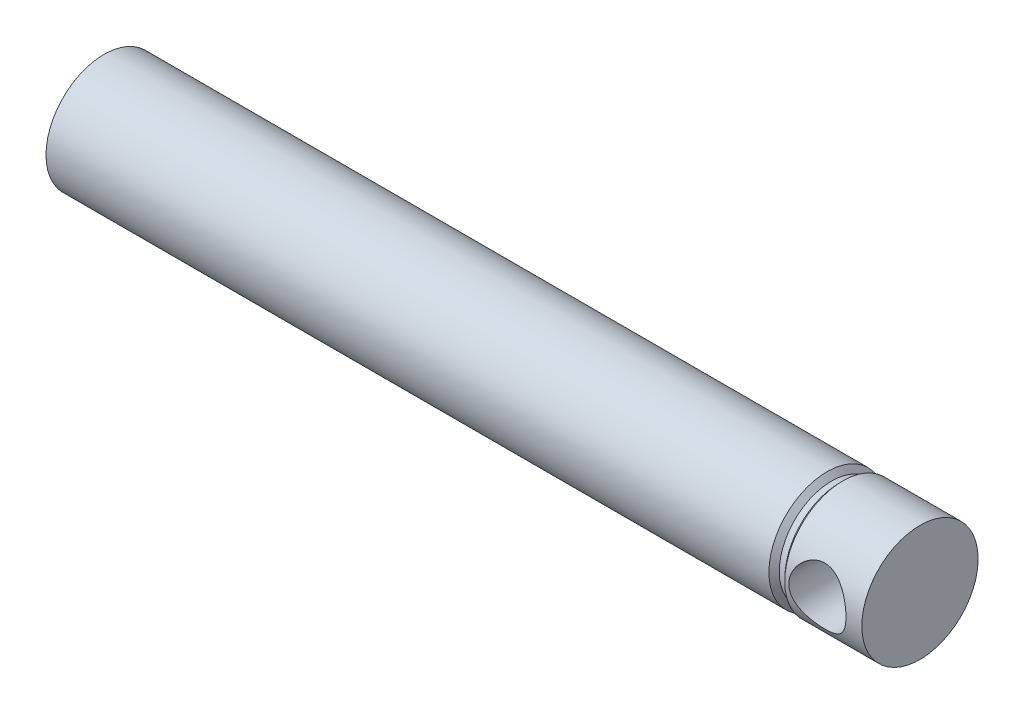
ISO-10303-21;
HEADER;
FILE_DESCRIPTION(('STEP AP214'),'2;1');
FILE_NAME('part.step','',(''),(''),'','','');
FILE_SCHEMA(('AUTOMOTIVE_DESIGN { 1 0 10303 214 1 1 1 1 }'));
ENDSEC;
DATA;
#1=APPLICATION_CONTEXT('core data for automotive mechanical design processes');
#2=APPLICATION_PROTOCOL_DEFINITION('international standard','automotive_design',2000,#1);
#3=PRODUCT_CONTEXT('',#1,'mechanical');
#4=PRODUCT('Part','Part','',(#3));
#5=PRODUCT_RELATED_PRODUCT_CATEGORY('part','',(#4));
#6=PRODUCT_DEFINITION_FORMATION('','',#4);
#7=PRODUCT_DEFINITION_CONTEXT('part definition',#1,'design');
#8=PRODUCT_DEFINITION('design','',#6,#7);
#9=PRODUCT_DEFINITION_SHAPE('','',#8);
#10=(LENGTH_UNIT() NAMED_UNIT(*) SI_UNIT(.MILLI.,.METRE.));
#11=(NAMED_UNIT(*) PLANE_ANGLE_UNIT() SI_UNIT($,.RADIAN.));
#12=(NAMED_UNIT(*) SI_UNIT($,.STERADIAN.) SOLID_ANGLE_UNIT());
#13=UNCERTAINTY_MEASURE_WITH_UNIT(LENGTH_MEASURE(1.E-05),#10,'distance_accuracy_value','');
#14=(GEOMETRIC_REPRESENTATION_CONTEXT(3) GLOBAL_UNCERTAINTY_ASSIGNED_CONTEXT((#13)) GLOBAL_UNIT_ASSIGNED_CONTEXT((#10,
#11,#12)) REPRESENTATION_CONTEXT('',''));
#15=CARTESIAN_POINT('',(0.,0.,0.));
#16=DIRECTION('',(0.,0.,1.));
#17=DIRECTION('',(1.,0.,0.));
#18=AXIS2_PLACEMENT_3D('',#15,#16,#17);
#19=CARTESIAN_POINT('',(90.,0.,0.));
#20=DIRECTION('',(-1.,0.,0.));
#21=DIRECTION('',(0.,0.,1.));
#22=AXIS2_PLACEMENT_3D('',#19,#20,#21);
#23=PLANE('',#22);
#24=CARTESIAN_POINT('',(90.,0.,0.));
#25=DIRECTION('',(-1.,0.,0.));
#26=DIRECTION('',(0.,0.,1.));
#27=AXIS2_PLACEMENT_3D('',#24,#25,#26);
#28=CIRCLE('',#27,14.25);
#29=CARTESIAN_POINT('',(90.,0.,14.25));
#30=VERTEX_POINT('',#29);
#31=EDGE_CURVE('E10',#30,#30,#28,.T.);
#32=ORIENTED_EDGE('',*,*,#31,.F.);
#33=EDGE_LOOP('',(#32));
#34=FACE_BOUND('',#33,.T.);
#35=ADVANCED_FACE('F26',(#34),#23,.F.);
#36=CARTESIAN_POINT('',(-110.,0.,0.));
#37=DIRECTION('',(-1.,0.,0.));
#38=DIRECTION('',(0.,0.,1.));
#39=AXIS2_PLACEMENT_3D('',#36,#37,#38);
#40=CYLINDRICAL_SURFACE('',#39,14.25);
#41=CARTESIAN_POINT('',(86.1000000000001,0.,14.25));
#42=CARTESIAN_POINT('',(86.0999991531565,-0.184470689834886,14.2499992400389));
#43=CARTESIAN_POINT('',(86.09269937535,-0.36896000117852,14.2464093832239));
#44=CARTESIAN_POINT('',(86.0635813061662,-0.736584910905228,14.2321399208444));
#45=CARTESIAN_POINT('',(86.041756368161,-0.91971985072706,14.2214570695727));
#46=CARTESIAN_POINT('',(85.9837997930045,-1.28345897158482,14.1932574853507));
#47=CARTESIAN_POINT('',(85.9476466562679,-1.46405892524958,14.175730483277));
#48=CARTESIAN_POINT('',(85.8614273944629,-1.8212269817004,14.1342835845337));
#49=CARTESIAN_POINT('',(85.8113555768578,-1.99779340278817,14.1103610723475));
#50=CARTESIAN_POINT('',(85.6980752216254,-2.34490764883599,14.0568352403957));
#51=CARTESIAN_POINT('',(85.6349240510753,-2.51547807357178,14.0272567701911));
#52=CARTESIAN_POINT('',(85.4959257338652,-2.85044438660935,13.9630429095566));
#53=CARTESIAN_POINT('',(85.420073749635,-3.014837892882,13.9284055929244));
#54=CARTESIAN_POINT('',(85.2563622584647,-3.33642533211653,13.8548889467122));
#55=CARTESIAN_POINT('',(85.168509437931,-3.49362320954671,13.8160119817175));
#56=CARTESIAN_POINT('',(84.9814014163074,-3.80018447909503,13.7348567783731));
#57=CARTESIAN_POINT('',(84.8821420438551,-3.94954497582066,13.692577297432));
#58=CARTESIAN_POINT('',(84.5559308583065,-4.40183273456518,13.5568784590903));
#59=CARTESIAN_POINT('',(84.3100979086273,-4.69011772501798,13.4590444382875));
#60=CARTESIAN_POINT('',(83.775530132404,-5.22322471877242,13.2612782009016));
#61=CARTESIAN_POINT('',(83.4867641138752,-5.46801483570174,13.1613445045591));
#62=CARTESIAN_POINT('',(83.014342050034,-5.80683049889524,13.0138371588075));
#63=CARTESIAN_POINT('',(82.8438072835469,-5.91823849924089,12.963414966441));
#64=CARTESIAN_POINT('',(82.4928791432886,-6.12616712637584,12.8664571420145));
#65=CARTESIAN_POINT('',(82.3124899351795,-6.22269397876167,12.819919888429));
#66=CARTESIAN_POINT('',(81.9429112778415,-6.399988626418,12.7323380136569));
#67=CARTESIAN_POINT('',(81.7537244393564,-6.48076106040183,12.691291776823));
#68=CARTESIAN_POINT('',(81.3677365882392,-6.62569617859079,12.6162323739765));
#69=CARTESIAN_POINT('',(81.1709363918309,-6.68986063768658,12.5822184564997));
#70=CARTESIAN_POINT('',(80.7829887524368,-6.79747396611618,12.5243906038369));
#71=CARTESIAN_POINT('',(80.5921899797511,-6.84191953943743,12.5000942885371));
#72=CARTESIAN_POINT('',(80.2066660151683,-6.91474966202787,12.4599548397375));
#73=CARTESIAN_POINT('',(80.0119409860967,-6.94313487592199,12.4441113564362));
#74=CARTESIAN_POINT('',(79.6204184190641,-6.98339902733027,12.4215608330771));
#75=CARTESIAN_POINT('',(79.4236226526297,-6.99529107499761,12.4148465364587));
#76=CARTESIAN_POINT('',(79.0296416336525,-7.00241792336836,12.4108285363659));
#77=CARTESIAN_POINT('',(78.8324564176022,-6.99765421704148,12.4135239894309));
#78=CARTESIAN_POINT('',(78.4621177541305,-6.97305482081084,12.4273555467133));
#79=CARTESIAN_POINT('',(78.2888037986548,-6.95501189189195,12.4374872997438));
#80=CARTESIAN_POINT('',(77.9444777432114,-6.90615755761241,12.4646809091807));
#81=CARTESIAN_POINT('',(77.7734664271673,-6.8753419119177,12.481745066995));
#82=CARTESIAN_POINT('',(77.4349594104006,-6.80129817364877,12.5222449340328));
#83=CARTESIAN_POINT('',(77.2674631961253,-6.75807190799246,12.5456797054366));
#84=CARTESIAN_POINT('',(76.9368826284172,-6.65963086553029,12.598211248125));
#85=CARTESIAN_POINT('',(76.7738000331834,-6.60441138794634,12.6273102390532));
#86=CARTESIAN_POINT('',(76.4492810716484,-6.48108797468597,12.6910567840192));
#87=CARTESIAN_POINT('',(76.2879677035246,-6.41271819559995,12.7258160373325));
#88=CARTESIAN_POINT('',(75.9716454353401,-6.26449774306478,12.7994302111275));
#89=CARTESIAN_POINT('',(75.8166388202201,-6.18464295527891,12.8382865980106));
#90=CARTESIAN_POINT('',(75.3621313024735,-5.9286758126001,12.9595122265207));
#91=CARTESIAN_POINT('',(75.0729869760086,-5.73610098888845,13.0465701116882));
#92=CARTESIAN_POINT('',(74.4938198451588,-5.28523033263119,13.2361427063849));
#93=CARTESIAN_POINT('',(74.2079811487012,-5.02178614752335,13.3392484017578));
#94=CARTESIAN_POINT('',(73.8143263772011,-4.59340685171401,13.4902256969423));
#95=CARTESIAN_POINT('',(73.6888794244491,-4.44495693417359,13.5399731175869));
#96=CARTESIAN_POINT('',(73.4504326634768,-4.13765239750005,13.6370174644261));
#97=CARTESIAN_POINT('',(73.3374281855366,-3.97880171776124,13.6843153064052));
#98=CARTESIAN_POINT('',(73.1199699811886,-3.64428010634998,13.7772702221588));
#99=CARTESIAN_POINT('',(73.0161109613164,-3.46817666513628,13.8227636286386));
#100=CARTESIAN_POINT('',(72.8237896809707,-3.10661944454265,13.9084832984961));
#101=CARTESIAN_POINT('',(72.7353205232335,-2.92116990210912,13.9487119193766));
#102=CARTESIAN_POINT('',(72.5746875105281,-2.54217221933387,14.0227358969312));
#103=CARTESIAN_POINT('',(72.5025176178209,-2.3486271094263,14.0565336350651));
#104=CARTESIAN_POINT('',(72.3753209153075,-1.95486145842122,14.1166803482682));
#105=CARTESIAN_POINT('',(72.3202922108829,-1.75464165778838,14.1430301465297));
#106=CARTESIAN_POINT('',(72.231844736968,-1.36563327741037,14.1856506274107));
#107=CARTESIAN_POINT('',(72.1970381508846,-1.17722985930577,14.2025641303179));
#108=CARTESIAN_POINT('',(72.1429584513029,-0.797689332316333,14.2289271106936));
#109=CARTESIAN_POINT('',(72.1236845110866,-0.606552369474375,14.23837698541));
#110=CARTESIAN_POINT('',(72.1009253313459,-0.223188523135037,14.2495420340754));
#111=CARTESIAN_POINT('',(72.0974340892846,-0.0309620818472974,14.2512601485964));
#112=CARTESIAN_POINT('',(72.1062710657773,0.353034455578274,14.2469199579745));
#113=CARTESIAN_POINT('',(72.1185986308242,0.544804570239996,14.2408619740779));
#114=CARTESIAN_POINT('',(72.1574023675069,0.912060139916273,14.2218811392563));
#115=CARTESIAN_POINT('',(72.1827555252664,1.08769402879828,14.2095035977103));
#116=CARTESIAN_POINT('',(72.2465995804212,1.43606095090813,14.1785336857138));
#117=CARTESIAN_POINT('',(72.2850949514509,1.60879297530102,14.1599391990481));
#118=CARTESIAN_POINT('',(72.3748109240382,1.95011853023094,14.1169798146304));
#119=CARTESIAN_POINT('',(72.4260274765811,2.11871335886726,14.0926167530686));
#120=CARTESIAN_POINT('',(72.5407258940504,2.45088002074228,14.0386615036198));
#121=CARTESIAN_POINT('',(72.6042125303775,2.61444987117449,14.0090672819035));
#122=CARTESIAN_POINT('',(72.7449039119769,2.94026136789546,13.9443798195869));
#123=CARTESIAN_POINT('',(72.8224518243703,3.10232829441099,13.9091524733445));
#124=CARTESIAN_POINT('',(72.9893291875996,3.41933026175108,13.8346390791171));
#125=CARTESIAN_POINT('',(73.0786626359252,3.57426285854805,13.7953516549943));
#126=CARTESIAN_POINT('',(73.3633896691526,4.02720794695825,13.6726639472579));
#127=CARTESIAN_POINT('',(73.5755835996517,4.31353698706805,13.5844032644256));
#128=CARTESIAN_POINT('',(74.0620549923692,4.87546042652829,13.3936076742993));
#129=CARTESIAN_POINT('',(74.3403269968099,5.14741576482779,13.2905146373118));
#130=CARTESIAN_POINT('',(74.7889437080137,5.51838417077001,13.1387936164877));
#131=CARTESIAN_POINT('',(74.943802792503,5.63594849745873,13.0886724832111));
#132=CARTESIAN_POINT('',(75.2633306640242,5.85814061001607,12.9907430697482));
#133=CARTESIAN_POINT('',(75.4280008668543,5.96276652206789,12.9429351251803));
#134=CARTESIAN_POINT('',(75.7737903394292,6.16262622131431,12.8490185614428));
#135=CARTESIAN_POINT('',(75.95531512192,6.25723878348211,12.8030789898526));
#136=CARTESIAN_POINT('',(76.3269996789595,6.43059010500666,12.7168935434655));
#137=CARTESIAN_POINT('',(76.517155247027,6.50933649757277,12.6766449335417));
#138=CARTESIAN_POINT('',(76.9047677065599,6.65007001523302,12.6033871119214));
#139=CARTESIAN_POINT('',(77.1022188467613,6.71207003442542,12.5703723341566));
#140=CARTESIAN_POINT('',(77.503008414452,6.81854742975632,12.512936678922));
#141=CARTESIAN_POINT('',(77.7063459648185,6.86302740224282,12.4885145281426));
#142=CARTESIAN_POINT('',(78.0976065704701,6.9304255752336,12.4512262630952));
#143=CARTESIAN_POINT('',(78.2851640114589,6.95498780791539,12.4374842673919));
#144=CARTESIAN_POINT('',(78.6620787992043,6.98884951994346,12.4184888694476));
#145=CARTESIAN_POINT('',(78.8514360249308,6.99815001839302,12.4132349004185));
#146=CARTESIAN_POINT('',(79.2302573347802,7.00135009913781,12.4114301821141));
#147=CARTESIAN_POINT('',(79.4197213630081,6.99525476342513,12.4148765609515));
#148=CARTESIAN_POINT('',(79.7971775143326,6.96776484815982,12.4303258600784));
#149=CARTESIAN_POINT('',(79.9851696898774,6.94637081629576,12.4423284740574));
#150=CARTESIAN_POINT('',(80.3414441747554,6.89117938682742,12.4729723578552));
#151=CARTESIAN_POINT('',(80.5099866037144,6.85866118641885,12.4909245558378));
#152=CARTESIAN_POINT('',(80.8435590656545,6.78154224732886,12.532961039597));
#153=CARTESIAN_POINT('',(81.00858790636,6.73693747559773,12.5570473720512));
#154=CARTESIAN_POINT('',(81.3341138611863,6.63609591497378,12.6106298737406));
#155=CARTESIAN_POINT('',(81.4946116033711,6.57986074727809,12.6401252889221));
#156=CARTESIAN_POINT('',(81.8103614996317,6.45621418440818,12.7037250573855));
#157=CARTESIAN_POINT('',(81.9656115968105,6.3887984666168,12.7378311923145));
#158=CARTESIAN_POINT('',(82.2803121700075,6.23843136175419,12.8121804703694));
#159=CARTESIAN_POINT('',(82.4393493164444,6.15474256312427,12.852681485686));
#160=CARTESIAN_POINT('',(82.7499506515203,5.9757844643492,12.9368573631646));
#161=CARTESIAN_POINT('',(82.9015122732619,5.8805112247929,12.9805333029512));
#162=CARTESIAN_POINT('',(83.1965253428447,5.67894385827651,13.0699752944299));
#163=CARTESIAN_POINT('',(83.3399747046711,5.57264691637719,13.1157418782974));
#164=CARTESIAN_POINT('',(83.6181506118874,5.3495891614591,13.2082919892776));
#165=CARTESIAN_POINT('',(83.7528765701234,5.23282764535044,13.2550755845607));
#166=CARTESIAN_POINT('',(84.0281468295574,4.9752288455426,13.3540546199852));
#167=CARTESIAN_POINT('',(84.1675517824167,4.83317008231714,13.4062480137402));
#168=CARTESIAN_POINT('',(84.4339527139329,4.53745979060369,13.5091991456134));
#169=CARTESIAN_POINT('',(84.5609523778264,4.38381172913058,13.5599573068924));
#170=CARTESIAN_POINT('',(84.801883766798,4.06551305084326,13.6587662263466));
#171=CARTESIAN_POINT('',(84.9158027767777,3.90085197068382,13.7068143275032));
#172=CARTESIAN_POINT('',(85.1295100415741,3.56162511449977,13.7988475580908));
#173=CARTESIAN_POINT('',(85.229304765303,3.38706392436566,13.8428345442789));
#174=CARTESIAN_POINT('',(85.4142985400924,3.02828777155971,13.9257315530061));
#175=CARTESIAN_POINT('',(85.4994381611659,2.84403728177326,13.9646207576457));
#176=CARTESIAN_POINT('',(85.6537045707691,2.46784500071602,14.0359847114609));
#177=CARTESIAN_POINT('',(85.7228392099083,2.27590703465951,14.0684626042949));
#178=CARTESIAN_POINT('',(85.8441846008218,1.88614470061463,14.1259929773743));
#179=CARTESIAN_POINT('',(85.8964329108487,1.6883344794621,14.1510619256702));
#180=CARTESIAN_POINT('',(85.9834954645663,1.28816676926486,14.193081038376));
#181=CARTESIAN_POINT('',(86.0183206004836,1.08581220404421,14.2100362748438));
#182=CARTESIAN_POINT('',(86.0627547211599,0.736031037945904,14.2317323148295));
#183=CARTESIAN_POINT('',(86.0767110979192,0.589269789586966,14.2385720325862));
#184=CARTESIAN_POINT('',(86.0953342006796,0.295009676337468,14.2477062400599));
#185=CARTESIAN_POINT('',(86.100000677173,0.147510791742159,14.250000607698));
#186=CARTESIAN_POINT('',(86.1000000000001,0.,14.25));
#187=B_SPLINE_CURVE_WITH_KNOTS('',3,(#41,#42,#43,#44,#45,#46,#47,#48,#49,#50,#51,#52,#53,#54,
#55,#56,#57,#58,#59,#60,#61,#62,#63,#64,#65,#66,#67,#68,#69,#70,#71,#72,#73,#74,#75,#76,#77,#78,
#79,#80,#81,#82,#83,#84,#85,#86,#87,#88,#89,#90,#91,#92,#93,#94,#95,#96,#97,#98,#99,#100,#101,
#102,#103,#104,#105,#106,#107,#108,#109,#110,#111,#112,#113,#114,#115,#116,#117,#118,#119,#120,
#121,#122,#123,#124,#125,#126,#127,#128,#129,#130,#131,#132,#133,#134,#135,#136,#137,#138,#139,
#140,#141,#142,#143,#144,#145,#146,#147,#148,#149,#150,#151,#152,#153,#154,#155,#156,#157,#158,
#159,#160,#161,#162,#163,#164,#165,#166,#167,#168,#169,#170,#171,#172,#173,#174,#175,#176,#177,
#178,#179,#180,#181,#182,#183,#184,#185,#186),.UNSPECIFIED.,.T.,.F.,(4,2,2,2,2,2,2,2,2,2,2,2,2,
2,2,2,2,2,2,2,2,2,2,2,2,2,2,2,2,2,2,2,2,2,2,2,2,2,2,2,2,2,2,2,2,2,2,2,2,2,2,2,2,2,2,2,2,2,2,2,2,
2,2,2,2,2,2,2,2,2,2,2,4),(0.,0.553266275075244,1.10678589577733,1.6611392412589,
2.21571964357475,2.76791725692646,3.32032567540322,3.87242755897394,4.42473199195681,
5.59341079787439,6.76294286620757,7.39181345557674,8.02042023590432,8.6488416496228,
9.27719587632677,9.86858034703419,10.4599403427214,11.0508300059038,11.6416667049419,
12.1646857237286,12.6878785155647,13.2109943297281,13.7343155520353,14.2696080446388,
14.8050927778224,15.8755579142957,17.0764300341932,17.6777504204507,18.2788443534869,
18.9063765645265,19.5336268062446,20.1606443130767,20.7875924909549,21.3638341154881,
21.940045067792,22.5160368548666,23.0920048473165,23.6250444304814,24.1582656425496,
24.6913173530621,25.2245767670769,25.7732335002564,26.3220768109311,27.419205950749,
28.6211530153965,29.2229652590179,29.8248645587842,30.4534224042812,31.0816771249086,
31.7094467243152,32.3371232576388,32.905309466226,33.4734577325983,34.0414184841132,
34.6093589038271,35.1265482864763,35.6439104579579,36.1612005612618,36.6786911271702,
37.2307860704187,37.783069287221,38.3354938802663,38.8879556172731,39.5045333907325,
40.1209274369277,40.7379156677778,41.3546203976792,41.9737699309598,42.5926151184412,
43.2100742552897,43.827146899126,44.2695508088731,44.7119666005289),.UNSPECIFIED.);
#188=CARTESIAN_POINT('',(86.1000000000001,0.,14.25));
#189=VERTEX_POINT('',#188);
#190=EDGE_CURVE('E29',#189,#189,#187,.T.);
#191=ORIENTED_EDGE('',*,*,#190,.T.);
#192=EDGE_LOOP('',(#191));
#193=FACE_BOUND('',#192,.T.);
#194=CARTESIAN_POINT('',(86.1,0.,-14.25));
#195=CARTESIAN_POINT('',(86.0999991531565,0.184470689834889,-14.2499992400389));
#196=CARTESIAN_POINT('',(86.09269937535,0.368960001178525,-14.2464093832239));
#197=CARTESIAN_POINT('',(86.0635813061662,0.736584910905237,-14.2321399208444));
#198=CARTESIAN_POINT('',(86.041756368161,0.919719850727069,-14.2214570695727));
#199=CARTESIAN_POINT('',(85.9837997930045,1.28345897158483,-14.1932574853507));
#200=CARTESIAN_POINT('',(85.9476466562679,1.46405892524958,-14.175730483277));
#201=CARTESIAN_POINT('',(85.861427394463,1.8212269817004,-14.1342835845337));
#202=CARTESIAN_POINT('',(85.8113555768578,1.99779340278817,-14.1103610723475));
#203=CARTESIAN_POINT('',(85.6980752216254,2.34490764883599,-14.0568352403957));
#204=CARTESIAN_POINT('',(85.6349240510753,2.51547807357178,-14.0272567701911));
#205=CARTESIAN_POINT('',(85.4959257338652,2.85044438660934,-13.9630429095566));
#206=CARTESIAN_POINT('',(85.420073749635,3.01483789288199,-13.9284055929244));
#207=CARTESIAN_POINT('',(85.2563622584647,3.33642533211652,-13.8548889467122));
#208=CARTESIAN_POINT('',(85.168509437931,3.49362320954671,-13.8160119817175));
#209=CARTESIAN_POINT('',(84.9814014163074,3.80018447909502,-13.7348567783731));
#210=CARTESIAN_POINT('',(84.8821420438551,3.94954497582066,-13.692577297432));
#211=CARTESIAN_POINT('',(84.5559308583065,4.40183273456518,-13.5568784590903));
#212=CARTESIAN_POINT('',(84.3100979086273,4.69011772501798,-13.4590444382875));
#213=CARTESIAN_POINT('',(83.775530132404,5.22322471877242,-13.2612782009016));
#214=CARTESIAN_POINT('',(83.4867641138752,5.46801483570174,-13.1613445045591));
#215=CARTESIAN_POINT('',(83.014342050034,5.80683049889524,-13.0138371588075));
#216=CARTESIAN_POINT('',(82.8438072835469,5.91823849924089,-12.963414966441));
#217=CARTESIAN_POINT('',(82.4928791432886,6.12616712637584,-12.8664571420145));
#218=CARTESIAN_POINT('',(82.3124899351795,6.22269397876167,-12.819919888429));
#219=CARTESIAN_POINT('',(81.9429112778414,6.399988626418,-12.7323380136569));
#220=CARTESIAN_POINT('',(81.7537244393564,6.48076106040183,-12.691291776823));
#221=CARTESIAN_POINT('',(81.3677365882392,6.62569617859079,-12.6162323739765));
#222=CARTESIAN_POINT('',(81.1709363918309,6.68986063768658,-12.5822184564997));
#223=CARTESIAN_POINT('',(80.7829887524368,6.79747396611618,-12.5243906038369));
#224=CARTESIAN_POINT('',(80.5921899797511,6.84191953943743,-12.5000942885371));
#225=CARTESIAN_POINT('',(80.2066660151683,6.91474966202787,-12.4599548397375));
#226=CARTESIAN_POINT('',(80.0119409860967,6.94313487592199,-12.4441113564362));
#227=CARTESIAN_POINT('',(79.6204184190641,6.98339902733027,-12.4215608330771));
#228=CARTESIAN_POINT('',(79.4236226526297,6.99529107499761,-12.4148465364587));
#229=CARTESIAN_POINT('',(79.0296416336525,7.00241792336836,-12.4108285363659));
#230=CARTESIAN_POINT('',(78.8324564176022,6.99765421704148,-12.4135239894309));
#231=CARTESIAN_POINT('',(78.4621177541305,6.97305482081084,-12.4273555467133));
#232=CARTESIAN_POINT('',(78.2888037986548,6.95501189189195,-12.4374872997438));
#233=CARTESIAN_POINT('',(77.9444777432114,6.90615755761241,-12.4646809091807));
#234=CARTESIAN_POINT('',(77.7734664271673,6.8753419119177,-12.481745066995));
#235=CARTESIAN_POINT('',(77.4349594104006,6.80129817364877,-12.5222449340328));
#236=CARTESIAN_POINT('',(77.2674631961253,6.75807190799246,-12.5456797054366));
#237=CARTESIAN_POINT('',(76.9368826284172,6.65963086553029,-12.598211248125));
#238=CARTESIAN_POINT('',(76.7738000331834,6.60441138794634,-12.6273102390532));
#239=CARTESIAN_POINT('',(76.4492810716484,6.48108797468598,-12.6910567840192));
#240=CARTESIAN_POINT('',(76.2879677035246,6.41271819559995,-12.7258160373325));
#241=CARTESIAN_POINT('',(75.9716454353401,6.26449774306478,-12.7994302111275));
#242=CARTESIAN_POINT('',(75.8166388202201,6.18464295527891,-12.8382865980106));
#243=CARTESIAN_POINT('',(75.3621313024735,5.9286758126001,-12.9595122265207));
#244=CARTESIAN_POINT('',(75.0729869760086,5.73610098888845,-13.0465701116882));
#245=CARTESIAN_POINT('',(74.4938198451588,5.28523033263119,-13.2361427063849));
#246=CARTESIAN_POINT('',(74.2079811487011,5.02178614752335,-13.3392484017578));
#247=CARTESIAN_POINT('',(73.8143263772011,4.59340685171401,-13.4902256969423));
#248=CARTESIAN_POINT('',(73.6888794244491,4.44495693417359,-13.5399731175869));
#249=CARTESIAN_POINT('',(73.4504326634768,4.13765239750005,-13.6370174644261));
#250=CARTESIAN_POINT('',(73.3374281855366,3.97880171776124,-13.6843153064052));
#251=CARTESIAN_POINT('',(73.1199699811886,3.64428010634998,-13.7772702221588));
#252=CARTESIAN_POINT('',(73.0161109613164,3.46817666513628,-13.8227636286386));
#253=CARTESIAN_POINT('',(72.8237896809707,3.10661944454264,-13.9084832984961));
#254=CARTESIAN_POINT('',(72.7353205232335,2.92116990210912,-13.9487119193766));
#255=CARTESIAN_POINT('',(72.5746875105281,2.54217221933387,-14.0227358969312));
#256=CARTESIAN_POINT('',(72.5025176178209,2.3486271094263,-14.0565336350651));
#257=CARTESIAN_POINT('',(72.3753209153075,1.95486145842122,-14.1166803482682));
#258=CARTESIAN_POINT('',(72.3202922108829,1.75464165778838,-14.1430301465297));
#259=CARTESIAN_POINT('',(72.231844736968,1.36563327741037,-14.1856506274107));
#260=CARTESIAN_POINT('',(72.1970381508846,1.17722985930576,-14.2025641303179));
#261=CARTESIAN_POINT('',(72.1429584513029,0.797689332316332,-14.2289271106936));
#262=CARTESIAN_POINT('',(72.1236845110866,0.606552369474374,-14.23837698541));
#263=CARTESIAN_POINT('',(72.1009253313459,0.223188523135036,-14.2495420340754));
#264=CARTESIAN_POINT('',(72.0974340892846,0.0309620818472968,-14.2512601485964));
#265=CARTESIAN_POINT('',(72.1062710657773,-0.353034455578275,-14.2469199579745));
#266=CARTESIAN_POINT('',(72.1185986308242,-0.544804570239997,-14.2408619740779));
#267=CARTESIAN_POINT('',(72.1574023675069,-0.912060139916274,-14.2218811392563));
#268=CARTESIAN_POINT('',(72.1827555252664,-1.08769402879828,-14.2095035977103));
#269=CARTESIAN_POINT('',(72.2465995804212,-1.43606095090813,-14.1785336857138));
#270=CARTESIAN_POINT('',(72.2850949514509,-1.60879297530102,-14.1599391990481));
#271=CARTESIAN_POINT('',(72.3748109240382,-1.95011853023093,-14.1169798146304));
#272=CARTESIAN_POINT('',(72.4260274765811,-2.11871335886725,-14.0926167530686));
#273=CARTESIAN_POINT('',(72.5407258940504,-2.45088002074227,-14.0386615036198));
#274=CARTESIAN_POINT('',(72.6042125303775,-2.61444987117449,-14.0090672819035));
#275=CARTESIAN_POINT('',(72.7449039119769,-2.94026136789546,-13.9443798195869));
#276=CARTESIAN_POINT('',(72.8224518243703,-3.10232829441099,-13.9091524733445));
#277=CARTESIAN_POINT('',(72.9893291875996,-3.41933026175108,-13.8346390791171));
#278=CARTESIAN_POINT('',(73.0786626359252,-3.57426285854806,-13.7953516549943));
#279=CARTESIAN_POINT('',(73.3633896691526,-4.02720794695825,-13.6726639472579));
#280=CARTESIAN_POINT('',(73.5755835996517,-4.31353698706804,-13.5844032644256));
#281=CARTESIAN_POINT('',(74.0620549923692,-4.87546042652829,-13.3936076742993));
#282=CARTESIAN_POINT('',(74.3403269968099,-5.14741576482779,-13.2905146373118));
#283=CARTESIAN_POINT('',(74.7889437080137,-5.51838417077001,-13.1387936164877));
#284=CARTESIAN_POINT('',(74.943802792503,-5.63594849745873,-13.0886724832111));
#285=CARTESIAN_POINT('',(75.2633306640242,-5.85814061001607,-12.9907430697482));
#286=CARTESIAN_POINT('',(75.4280008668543,-5.96276652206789,-12.9429351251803));
#287=CARTESIAN_POINT('',(75.7737903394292,-6.16262622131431,-12.8490185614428));
#288=CARTESIAN_POINT('',(75.95531512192,-6.25723878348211,-12.8030789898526));
#289=CARTESIAN_POINT('',(76.3269996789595,-6.43059010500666,-12.7168935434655));
#290=CARTESIAN_POINT('',(76.517155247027,-6.50933649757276,-12.6766449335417));
#291=CARTESIAN_POINT('',(76.9047677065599,-6.65007001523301,-12.6033871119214));
#292=CARTESIAN_POINT('',(77.1022188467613,-6.71207003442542,-12.5703723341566));
#293=CARTESIAN_POINT('',(77.503008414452,-6.81854742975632,-12.512936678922));
#294=CARTESIAN_POINT('',(77.7063459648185,-6.86302740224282,-12.4885145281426));
#295=CARTESIAN_POINT('',(78.0976065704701,-6.9304255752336,-12.4512262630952));
#296=CARTESIAN_POINT('',(78.2851640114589,-6.95498780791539,-12.4374842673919));
#297=CARTESIAN_POINT('',(78.6620787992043,-6.98884951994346,-12.4184888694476));
#298=CARTESIAN_POINT('',(78.8514360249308,-6.99815001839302,-12.4132349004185));
#299=CARTESIAN_POINT('',(79.2302573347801,-7.00135009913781,-12.4114301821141));
#300=CARTESIAN_POINT('',(79.4197213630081,-6.99525476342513,-12.4148765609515));
#301=CARTESIAN_POINT('',(79.7971775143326,-6.96776484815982,-12.4303258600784));
#302=CARTESIAN_POINT('',(79.9851696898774,-6.94637081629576,-12.4423284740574));
#303=CARTESIAN_POINT('',(80.3414441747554,-6.89117938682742,-12.4729723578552));
#304=CARTESIAN_POINT('',(80.5099866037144,-6.85866118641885,-12.4909245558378));
#305=CARTESIAN_POINT('',(80.8435590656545,-6.78154224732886,-12.532961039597));
#306=CARTESIAN_POINT('',(81.00858790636,-6.73693747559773,-12.5570473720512));
#307=CARTESIAN_POINT('',(81.3341138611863,-6.63609591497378,-12.6106298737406));
#308=CARTESIAN_POINT('',(81.4946116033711,-6.57986074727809,-12.6401252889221));
#309=CARTESIAN_POINT('',(81.8103614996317,-6.45621418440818,-12.7037250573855));
#310=CARTESIAN_POINT('',(81.9656115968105,-6.3887984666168,-12.7378311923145));
#311=CARTESIAN_POINT('',(82.2803121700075,-6.23843136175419,-12.8121804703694));
#312=CARTESIAN_POINT('',(82.4393493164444,-6.15474256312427,-12.852681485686));
#313=CARTESIAN_POINT('',(82.7499506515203,-5.9757844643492,-12.9368573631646));
#314=CARTESIAN_POINT('',(82.9015122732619,-5.8805112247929,-12.9805333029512));
#315=CARTESIAN_POINT('',(83.1965253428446,-5.67894385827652,-13.0699752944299));
#316=CARTESIAN_POINT('',(83.3399747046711,-5.5726469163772,-13.1157418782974));
#317=CARTESIAN_POINT('',(83.6181506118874,-5.34958916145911,-13.2082919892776));
#318=CARTESIAN_POINT('',(83.7528765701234,-5.23282764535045,-13.2550755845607));
#319=CARTESIAN_POINT('',(84.0281468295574,-4.9752288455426,-13.3540546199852));
#320=CARTESIAN_POINT('',(84.1675517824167,-4.83317008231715,-13.4062480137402));
#321=CARTESIAN_POINT('',(84.4339527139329,-4.5374597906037,-13.5091991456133));
#322=CARTESIAN_POINT('',(84.5609523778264,-4.38381172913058,-13.5599573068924));
#323=CARTESIAN_POINT('',(84.801883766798,-4.06551305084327,-13.6587662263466));
#324=CARTESIAN_POINT('',(84.9158027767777,-3.90085197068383,-13.7068143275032));
#325=CARTESIAN_POINT('',(85.1295100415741,-3.56162511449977,-13.7988475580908));
#326=CARTESIAN_POINT('',(85.229304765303,-3.38706392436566,-13.8428345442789));
#327=CARTESIAN_POINT('',(85.4142985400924,-3.02828777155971,-13.9257315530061));
#328=CARTESIAN_POINT('',(85.4994381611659,-2.84403728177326,-13.9646207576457));
#329=CARTESIAN_POINT('',(85.6537045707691,-2.46784500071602,-14.0359847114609));
#330=CARTESIAN_POINT('',(85.7228392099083,-2.27590703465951,-14.0684626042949));
#331=CARTESIAN_POINT('',(85.8441846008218,-1.88614470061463,-14.1259929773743));
#332=CARTESIAN_POINT('',(85.8964329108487,-1.6883344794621,-14.1510619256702));
#333=CARTESIAN_POINT('',(85.9834954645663,-1.28816676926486,-14.193081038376));
#334=CARTESIAN_POINT('',(86.0183206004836,-1.08581220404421,-14.2100362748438));
#335=CARTESIAN_POINT('',(86.0627547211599,-0.736031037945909,-14.2317323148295));
#336=CARTESIAN_POINT('',(86.0767110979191,-0.589269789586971,-14.2385720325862));
#337=CARTESIAN_POINT('',(86.0953342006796,-0.295009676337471,-14.2477062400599));
#338=CARTESIAN_POINT('',(86.1000006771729,-0.147510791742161,-14.250000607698));
#339=CARTESIAN_POINT('',(86.1,0.,-14.25));
#340=B_SPLINE_CURVE_WITH_KNOTS('',3,(#194,#195,#196,#197,#198,#199,#200,#201,#202,#203,#204,
#205,#206,#207,#208,#209,#210,#211,#212,#213,#214,#215,#216,#217,#218,#219,#220,#221,#222,#223,
#224,#225,#226,#227,#228,#229,#230,#231,#232,#233,#234,#235,#236,#237,#238,#239,#240,#241,#242,
#243,#244,#245,#246,#247,#248,#249,#250,#251,#252,#253,#254,#255,#256,#257,#258,#259,#260,#261,
#262,#263,#264,#265,#266,#267,#268,#269,#270,#271,#272,#273,#274,#275,#276,#277,#278,#279,#280,
#281,#282,#283,#284,#285,#286,#287,#288,#289,#290,#291,#292,#293,#294,#295,#296,#297,#298,#299,
#300,#301,#302,#303,#304,#305,#306,#307,#308,#309,#310,#311,#312,#313,#314,#315,#316,#317,#318,
#319,#320,#321,#322,#323,#324,#325,#326,#327,#328,#329,#330,#331,#332,#333,#334,#335,#336,#337,
#338,#339),.UNSPECIFIED.,.T.,.F.,(4,2,2,2,2,2,2,2,2,2,2,2,2,2,2,2,2,2,2,2,2,2,2,2,2,2,2,2,2,2,2,
2,2,2,2,2,2,2,2,2,2,2,2,2,2,2,2,2,2,2,2,2,2,2,2,2,2,2,2,2,2,2,2,2,2,2,2,2,2,2,2,2,4),(0.,
0.55326627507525,1.10678589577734,1.6611392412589,2.21571964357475,2.76791725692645,
3.32032567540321,3.87242755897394,4.42473199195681,5.59341079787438,6.76294286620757,
7.39181345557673,8.02042023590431,8.64884164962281,9.27719587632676,9.86858034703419,
10.4599403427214,11.0508300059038,11.6416667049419,12.1646857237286,12.6878785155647,
13.2109943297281,13.7343155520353,14.2696080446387,14.8050927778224,15.8755579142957,
17.0764300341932,17.6777504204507,18.2788443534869,18.9063765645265,19.5336268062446,
20.1606443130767,20.7875924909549,21.3638341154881,21.940045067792,22.5160368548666,
23.0920048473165,23.6250444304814,24.1582656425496,24.6913173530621,25.2245767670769,
25.7732335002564,26.3220768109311,27.419205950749,28.6211530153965,29.2229652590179,
29.8248645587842,30.4534224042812,31.0816771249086,31.7094467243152,32.3371232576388,
32.905309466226,33.4734577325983,34.0414184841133,34.6093589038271,35.1265482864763,
35.6439104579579,36.1612005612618,36.6786911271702,37.2307860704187,37.783069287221,
38.3354938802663,38.8879556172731,39.5045333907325,40.1209274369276,40.7379156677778,
41.3546203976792,41.9737699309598,42.5926151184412,43.2100742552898,43.827146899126,
44.2695508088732,44.7119666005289),.UNSPECIFIED.);
#341=CARTESIAN_POINT('',(86.1,0.,-14.25));
#342=VERTEX_POINT('',#341);
#343=EDGE_CURVE('E44',#342,#342,#340,.T.);
#344=ORIENTED_EDGE('',*,*,#343,.T.);
#345=EDGE_LOOP('',(#344));
#346=FACE_BOUND('',#345,.T.);
#347=CARTESIAN_POINT('',(71.1,0.,0.));
#348=DIRECTION('',(-1.,0.,0.));
#349=DIRECTION('',(0.,0.,1.));
#350=AXIS2_PLACEMENT_3D('',#347,#348,#349);
#351=CIRCLE('',#350,14.25);
#352=CARTESIAN_POINT('',(71.1,0.,14.25));
#353=VERTEX_POINT('',#352);
#354=EDGE_CURVE('E36',#353,#353,#351,.T.);
#355=ORIENTED_EDGE('',*,*,#354,.F.);
#356=EDGE_LOOP('',(#355));
#357=FACE_BOUND('',#356,.T.);
#358=ORIENTED_EDGE('',*,*,#31,.T.);
#359=EDGE_LOOP('',(#358));
#360=FACE_BOUND('',#359,.T.);
#361=ADVANCED_FACE('F48',(#193,#346,#357,#360),#40,.T.);
#362=CARTESIAN_POINT('',(71.1,0.,0.));
#363=DIRECTION('',(1.,0.,0.));
#364=DIRECTION('',(0.,0.,-1.));
#365=AXIS2_PLACEMENT_3D('',#362,#363,#364);
#366=CONICAL_SURFACE('',#365,14.25,0.809821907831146);
#367=CARTESIAN_POINT('',(70.2530320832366,0.,0.));
#368=DIRECTION('',(-1.,0.,0.));
#369=DIRECTION('',(0.,0.,1.));
#370=AXIS2_PLACEMENT_3D('',#367,#368,#369);
#371=CIRCLE('',#370,13.3606154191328);
#372=CARTESIAN_POINT('',(70.2530320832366,0.,13.3606154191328));
#373=VERTEX_POINT('',#372);
#374=EDGE_CURVE('E41',#373,#373,#371,.T.);
#375=ORIENTED_EDGE('',*,*,#374,.F.);
#376=EDGE_LOOP('',(#375));
#377=FACE_BOUND('',#376,.T.);
#378=ORIENTED_EDGE('',*,*,#354,.T.);
#379=EDGE_LOOP('',(#378));
#380=FACE_BOUND('',#379,.T.);
#381=ADVANCED_FACE('F71',(#377,#380),#366,.T.);
#382=CARTESIAN_POINT('',(70.2530320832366,0.,0.));
#383=DIRECTION('',(1.,0.,0.));
#384=DIRECTION('',(0.,0.,-1.));
#385=AXIS2_PLACEMENT_3D('',#382,#383,#384);
#386=CONICAL_SURFACE('',#385,13.3606154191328,0.270946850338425);
#387=CARTESIAN_POINT('',(68.3353508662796,0.,0.));
#388=DIRECTION('',(-1.,0.,0.));
#389=DIRECTION('',(0.,0.,1.));
#390=AXIS2_PLACEMENT_3D('',#387,#388,#389);
#391=CIRCLE('',#390,12.8279261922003);
#392=CARTESIAN_POINT('',(68.3353508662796,0.,12.8279261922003));
#393=VERTEX_POINT('',#392);
#394=EDGE_CURVE('E117',#393,#393,#391,.T.);
#395=ORIENTED_EDGE('',*,*,#394,.F.);
#396=EDGE_LOOP('',(#395));
#397=FACE_BOUND('',#396,.T.);
#398=ORIENTED_EDGE('',*,*,#374,.T.);
#399=EDGE_LOOP('',(#398));
#400=FACE_BOUND('',#399,.T.);
#401=ADVANCED_FACE('F68',(#397,#400),#386,.T.);
#402=CARTESIAN_POINT('',(68.3353508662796,0.,0.));
#403=DIRECTION('',(-1.,0.,0.));
#404=DIRECTION('',(0.,0.,1.));
#405=AXIS2_PLACEMENT_3D('',#402,#403,#404);
#406=CONICAL_SURFACE('',#405,12.8279261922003,0.904260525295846);
#407=CARTESIAN_POINT('',(67.2167034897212,0.,0.));
#408=DIRECTION('',(-1.,0.,0.));
#409=DIRECTION('',(0.,0.,1.));
#410=AXIS2_PLACEMENT_3D('',#407,#408,#409);
#411=CIRCLE('',#410,14.25);
#412=CARTESIAN_POINT('',(67.2167034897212,0.,14.25));
#413=VERTEX_POINT('',#412);
#414=EDGE_CURVE('E119',#413,#413,#411,.T.);
#415=ORIENTED_EDGE('',*,*,#414,.F.);
#416=EDGE_LOOP('',(#415));
#417=FACE_BOUND('',#416,.T.);
#418=ORIENTED_EDGE('',*,*,#394,.T.);
#419=EDGE_LOOP('',(#418));
#420=FACE_BOUND('',#419,.T.);
#421=ADVANCED_FACE('F64',(#417,#420),#406,.T.);
#422=CARTESIAN_POINT('',(-110.,0.,0.));
#423=DIRECTION('',(-1.,0.,0.));
#424=DIRECTION('',(0.,0.,1.));
#425=AXIS2_PLACEMENT_3D('',#422,#423,#424);
#426=CYLINDRICAL_SURFACE('',#425,14.25);
#427=CARTESIAN_POINT('',(-110.,0.,0.));
#428=DIRECTION('',(-1.,0.,0.));
#429=DIRECTION('',(0.,0.,1.));
#430=AXIS2_PLACEMENT_3D('',#427,#428,#429);
#431=CIRCLE('',#430,14.25);
#432=CARTESIAN_POINT('',(-110.,0.,14.25));
#433=VERTEX_POINT('',#432);
#434=EDGE_CURVE('E124',#433,#433,#431,.T.);
#435=ORIENTED_EDGE('',*,*,#434,.F.);
#436=EDGE_LOOP('',(#435));
#437=FACE_BOUND('',#436,.T.);
#438=ORIENTED_EDGE('',*,*,#414,.T.);
#439=EDGE_LOOP('',(#438));
#440=FACE_BOUND('',#439,.T.);
#441=ADVANCED_FACE('F60',(#437,#440),#426,.T.);
#442=CARTESIAN_POINT('',(-110.,14.25,0.));
#443=DIRECTION('',(1.,0.,0.));
#444=DIRECTION('',(0.,0.,-1.));
#445=AXIS2_PLACEMENT_3D('',#442,#443,#444);
#446=PLANE('',#445);
#447=ORIENTED_EDGE('',*,*,#434,.T.);
#448=EDGE_LOOP('',(#447));
#449=FACE_BOUND('',#448,.T.);
#450=ADVANCED_FACE('F55',(#449),#446,.F.);
#451=CARTESIAN_POINT('',(79.1,0.,-14.5));
#452=DIRECTION('',(0.,0.,1.));
#453=DIRECTION('',(1.,0.,0.));
#454=AXIS2_PLACEMENT_3D('',#451,#452,#453);
#455=CYLINDRICAL_SURFACE('',#454,7.);
#456=ORIENTED_EDGE('',*,*,#343,.F.);
#457=EDGE_LOOP('',(#456));
#458=FACE_BOUND('',#457,.T.);
#459=ORIENTED_EDGE('',*,*,#190,.F.);
#460=EDGE_LOOP('',(#459));
#461=FACE_BOUND('',#460,.T.);
#462=ADVANCED_FACE('F51',(#458,#461),#455,.F.);
#463=CLOSED_SHELL('',(#35,#361,#381,#401,#421,#441,#450,#462));
#464=MANIFOLD_SOLID_BREP('B2',#463);
#465=ADVANCED_BREP_SHAPE_REPRESENTATION('',(#18,#464),#14);
#466=SHAPE_DEFINITION_REPRESENTATION(#9,#465);
ENDSEC;
END-ISO-10303-21;
